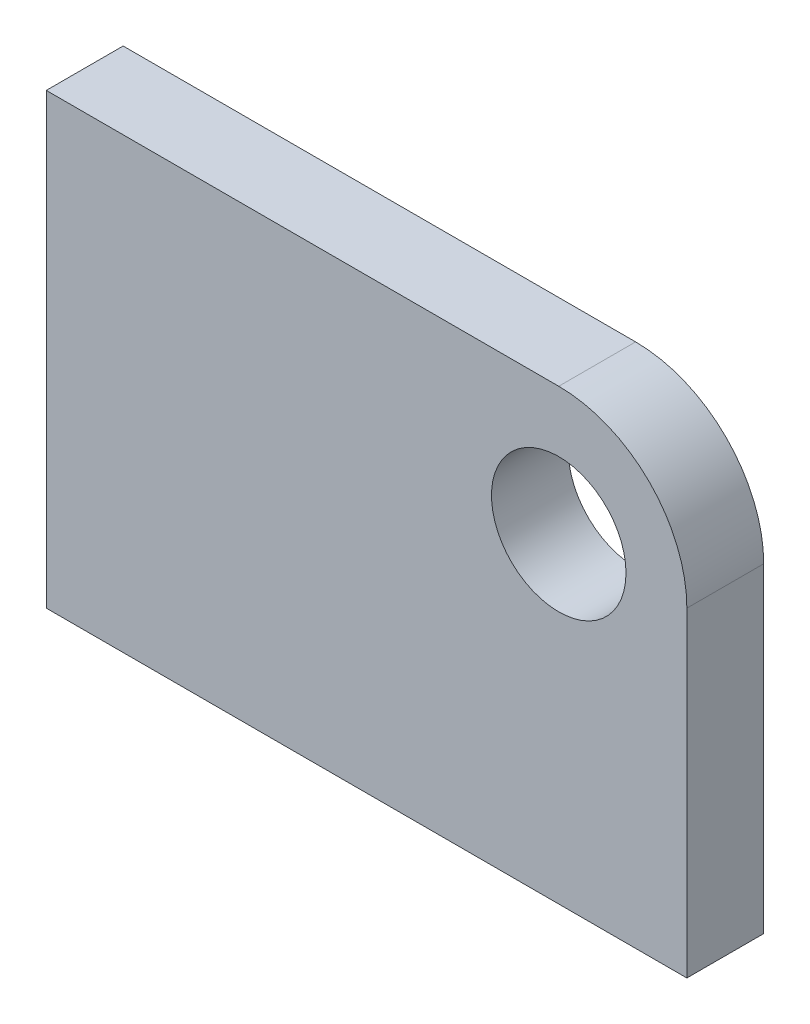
ISO-10303-21;
HEADER;
FILE_DESCRIPTION(('STEP AP214'),'2;1');
FILE_NAME('part.step','',(''),(''),'','','');
FILE_SCHEMA(('AUTOMOTIVE_DESIGN { 1 0 10303 214 1 1 1 1 }'));
ENDSEC;
DATA;
#1=APPLICATION_CONTEXT('core data for automotive mechanical design processes');
#2=APPLICATION_PROTOCOL_DEFINITION('international standard','automotive_design',2000,#1);
#3=PRODUCT_CONTEXT('',#1,'mechanical');
#4=PRODUCT('Part','Part','',(#3));
#5=PRODUCT_RELATED_PRODUCT_CATEGORY('part','',(#4));
#6=PRODUCT_DEFINITION_FORMATION('','',#4);
#7=PRODUCT_DEFINITION_CONTEXT('part definition',#1,'design');
#8=PRODUCT_DEFINITION('design','',#6,#7);
#9=PRODUCT_DEFINITION_SHAPE('','',#8);
#10=(LENGTH_UNIT() NAMED_UNIT(*) SI_UNIT(.MILLI.,.METRE.));
#11=(NAMED_UNIT(*) PLANE_ANGLE_UNIT() SI_UNIT($,.RADIAN.));
#12=(NAMED_UNIT(*) SI_UNIT($,.STERADIAN.) SOLID_ANGLE_UNIT());
#13=UNCERTAINTY_MEASURE_WITH_UNIT(LENGTH_MEASURE(1.E-05),#10,'distance_accuracy_value','');
#14=(GEOMETRIC_REPRESENTATION_CONTEXT(3) GLOBAL_UNCERTAINTY_ASSIGNED_CONTEXT((#13)) GLOBAL_UNIT_ASSIGNED_CONTEXT((#10,
#11,#12)) REPRESENTATION_CONTEXT('',''));
#15=CARTESIAN_POINT('',(0.,0.,0.));
#16=DIRECTION('',(0.,0.,1.));
#17=DIRECTION('',(1.,0.,0.));
#18=AXIS2_PLACEMENT_3D('',#15,#16,#17);
#19=CARTESIAN_POINT('',(80.,-20.,12.));
#20=DIRECTION('',(0.,0.,1.));
#21=DIRECTION('',(1.,0.,0.));
#22=AXIS2_PLACEMENT_3D('',#19,#20,#21);
#23=PLANE('',#22);
#24=DIRECTION('',(0.,-1.,0.));
#25=VECTOR('',#24,1.);
#26=CARTESIAN_POINT('',(0.,0.,12.));
#27=LINE('',#26,#25);
#28=CARTESIAN_POINT('',(0.,0.,12.));
#29=VERTEX_POINT('',#28);
#30=CARTESIAN_POINT('',(0.,-70.,12.));
#31=VERTEX_POINT('',#30);
#32=EDGE_CURVE('E108',#29,#31,#27,.T.);
#33=ORIENTED_EDGE('',*,*,#32,.T.);
#34=DIRECTION('',(1.,0.,0.));
#35=VECTOR('',#34,1.);
#36=CARTESIAN_POINT('',(0.,-70.,12.));
#37=LINE('',#36,#35);
#38=CARTESIAN_POINT('',(100.,-70.,12.));
#39=VERTEX_POINT('',#38);
#40=EDGE_CURVE('E91',#31,#39,#37,.T.);
#41=ORIENTED_EDGE('',*,*,#40,.T.);
#42=DIRECTION('',(0.,1.,0.));
#43=VECTOR('',#42,1.);
#44=CARTESIAN_POINT('',(100.,-20.0000000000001,12.));
#45=LINE('',#44,#43);
#46=CARTESIAN_POINT('',(100.,-20.0000000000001,12.));
#47=VERTEX_POINT('',#46);
#48=EDGE_CURVE('E111',#39,#47,#45,.T.);
#49=ORIENTED_EDGE('',*,*,#48,.T.);
#50=CARTESIAN_POINT('',(80.,-20.,12.));
#51=DIRECTION('',(0.,0.,1.));
#52=DIRECTION('',(1.,0.,0.));
#53=AXIS2_PLACEMENT_3D('',#50,#51,#52);
#54=CIRCLE('',#53,20.);
#55=CARTESIAN_POINT('',(79.9999999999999,0.,12.));
#56=VERTEX_POINT('',#55);
#57=EDGE_CURVE('E50',#47,#56,#54,.T.);
#58=ORIENTED_EDGE('',*,*,#57,.T.);
#59=DIRECTION('',(-1.,0.,0.));
#60=VECTOR('',#59,1.);
#61=CARTESIAN_POINT('',(0.,0.,12.));
#62=LINE('',#61,#60);
#63=EDGE_CURVE('E45',#56,#29,#62,.T.);
#64=ORIENTED_EDGE('',*,*,#63,.T.);
#65=EDGE_LOOP('',(#33,#41,#49,#58,#64));
#66=FACE_BOUND('',#65,.T.);
#67=CARTESIAN_POINT('',(80.,-20.,12.));
#68=DIRECTION('',(0.,0.,1.));
#69=DIRECTION('',(1.,0.,0.));
#70=AXIS2_PLACEMENT_3D('',#67,#68,#69);
#71=CIRCLE('',#70,10.5);
#72=CARTESIAN_POINT('',(90.5,-20.,12.));
#73=VERTEX_POINT('',#72);
#74=EDGE_CURVE('E96',#73,#73,#71,.T.);
#75=ORIENTED_EDGE('',*,*,#74,.F.);
#76=EDGE_LOOP('',(#75));
#77=FACE_BOUND('',#76,.T.);
#78=ADVANCED_FACE('F30',(#66,#77),#23,.T.);
#79=CARTESIAN_POINT('',(80.,-20.,0.));
#80=DIRECTION('',(0.,0.,1.));
#81=DIRECTION('',(1.,0.,0.));
#82=AXIS2_PLACEMENT_3D('',#79,#80,#81);
#83=PLANE('',#82);
#84=DIRECTION('',(0.,-1.,0.));
#85=VECTOR('',#84,1.);
#86=CARTESIAN_POINT('',(0.,0.,0.));
#87=LINE('',#86,#85);
#88=CARTESIAN_POINT('',(0.,0.,0.));
#89=VERTEX_POINT('',#88);
#90=CARTESIAN_POINT('',(0.,-70.,0.));
#91=VERTEX_POINT('',#90);
#92=EDGE_CURVE('E82',#89,#91,#87,.T.);
#93=ORIENTED_EDGE('',*,*,#92,.F.);
#94=DIRECTION('',(-1.,0.,0.));
#95=VECTOR('',#94,1.);
#96=CARTESIAN_POINT('',(0.,0.,0.));
#97=LINE('',#96,#95);
#98=CARTESIAN_POINT('',(79.9999999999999,0.,0.));
#99=VERTEX_POINT('',#98);
#100=EDGE_CURVE('E106',#99,#89,#97,.T.);
#101=ORIENTED_EDGE('',*,*,#100,.F.);
#102=CARTESIAN_POINT('',(80.,-20.,0.));
#103=DIRECTION('',(0.,0.,1.));
#104=DIRECTION('',(1.,0.,0.));
#105=AXIS2_PLACEMENT_3D('',#102,#103,#104);
#106=CIRCLE('',#105,20.);
#107=CARTESIAN_POINT('',(100.,-20.0000000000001,0.));
#108=VERTEX_POINT('',#107);
#109=EDGE_CURVE('E104',#108,#99,#106,.T.);
#110=ORIENTED_EDGE('',*,*,#109,.F.);
#111=DIRECTION('',(0.,1.,0.));
#112=VECTOR('',#111,1.);
#113=CARTESIAN_POINT('',(100.,-20.0000000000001,0.));
#114=LINE('',#113,#112);
#115=CARTESIAN_POINT('',(100.,-70.,0.));
#116=VERTEX_POINT('',#115);
#117=EDGE_CURVE('E84',#116,#108,#114,.T.);
#118=ORIENTED_EDGE('',*,*,#117,.F.);
#119=DIRECTION('',(1.,0.,0.));
#120=VECTOR('',#119,1.);
#121=CARTESIAN_POINT('',(0.,-70.,0.));
#122=LINE('',#121,#120);
#123=EDGE_CURVE('E77',#91,#116,#122,.T.);
#124=ORIENTED_EDGE('',*,*,#123,.F.);
#125=EDGE_LOOP('',(#93,#101,#110,#118,#124));
#126=FACE_BOUND('',#125,.T.);
#127=CARTESIAN_POINT('',(80.,-20.,0.));
#128=DIRECTION('',(0.,0.,1.));
#129=DIRECTION('',(1.,0.,0.));
#130=AXIS2_PLACEMENT_3D('',#127,#128,#129);
#131=CIRCLE('',#130,10.5);
#132=CARTESIAN_POINT('',(90.5,-20.,0.));
#133=VERTEX_POINT('',#132);
#134=EDGE_CURVE('E99',#133,#133,#131,.T.);
#135=ORIENTED_EDGE('',*,*,#134,.T.);
#136=EDGE_LOOP('',(#135));
#137=FACE_BOUND('',#136,.T.);
#138=ADVANCED_FACE('F78',(#126,#137),#83,.F.);
#139=CARTESIAN_POINT('',(0.,0.,12.));
#140=DIRECTION('',(1.,0.,0.));
#141=DIRECTION('',(0.,1.,0.));
#142=AXIS2_PLACEMENT_3D('',#139,#140,#141);
#143=PLANE('',#142);
#144=ORIENTED_EDGE('',*,*,#92,.T.);
#145=DIRECTION('',(0.,0.,-1.));
#146=VECTOR('',#145,1.);
#147=CARTESIAN_POINT('',(0.,-70.,12.));
#148=LINE('',#147,#146);
#149=EDGE_CURVE('E11',#31,#91,#148,.T.);
#150=ORIENTED_EDGE('',*,*,#149,.F.);
#151=ORIENTED_EDGE('',*,*,#32,.F.);
#152=DIRECTION('',(0.,0.,-1.));
#153=VECTOR('',#152,1.);
#154=CARTESIAN_POINT('',(0.,0.,12.));
#155=LINE('',#154,#153);
#156=EDGE_CURVE('E95',#29,#89,#155,.T.);
#157=ORIENTED_EDGE('',*,*,#156,.T.);
#158=EDGE_LOOP('',(#144,#150,#151,#157));
#159=FACE_BOUND('',#158,.T.);
#160=ADVANCED_FACE('F32',(#159),#143,.F.);
#161=CARTESIAN_POINT('',(0.,-70.,12.));
#162=DIRECTION('',(0.,1.,0.));
#163=DIRECTION('',(0.,0.,1.));
#164=AXIS2_PLACEMENT_3D('',#161,#162,#163);
#165=PLANE('',#164);
#166=ORIENTED_EDGE('',*,*,#123,.T.);
#167=DIRECTION('',(0.,0.,-1.));
#168=VECTOR('',#167,1.);
#169=CARTESIAN_POINT('',(100.,-70.,12.));
#170=LINE('',#169,#168);
#171=EDGE_CURVE('E38',#39,#116,#170,.T.);
#172=ORIENTED_EDGE('',*,*,#171,.F.);
#173=ORIENTED_EDGE('',*,*,#40,.F.);
#174=ORIENTED_EDGE('',*,*,#149,.T.);
#175=EDGE_LOOP('',(#166,#172,#173,#174));
#176=FACE_BOUND('',#175,.T.);
#177=ADVANCED_FACE('F90',(#176),#165,.F.);
#178=CARTESIAN_POINT('',(100.,-20.0000000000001,12.));
#179=DIRECTION('',(-1.,0.,0.));
#180=DIRECTION('',(0.,0.,1.));
#181=AXIS2_PLACEMENT_3D('',#178,#179,#180);
#182=PLANE('',#181);
#183=ORIENTED_EDGE('',*,*,#117,.T.);
#184=DIRECTION('',(0.,0.,-1.));
#185=VECTOR('',#184,1.);
#186=CARTESIAN_POINT('',(100.,-20.0000000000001,12.));
#187=LINE('',#186,#185);
#188=EDGE_CURVE('E119',#47,#108,#187,.T.);
#189=ORIENTED_EDGE('',*,*,#188,.F.);
#190=ORIENTED_EDGE('',*,*,#48,.F.);
#191=ORIENTED_EDGE('',*,*,#171,.T.);
#192=EDGE_LOOP('',(#183,#189,#190,#191));
#193=FACE_BOUND('',#192,.T.);
#194=ADVANCED_FACE('F123',(#193),#182,.F.);
#195=CARTESIAN_POINT('',(80.,-20.,12.));
#196=DIRECTION('',(0.,0.,-1.));
#197=DIRECTION('',(-1.,0.,0.));
#198=AXIS2_PLACEMENT_3D('',#195,#196,#197);
#199=CYLINDRICAL_SURFACE('',#198,20.);
#200=ORIENTED_EDGE('',*,*,#109,.T.);
#201=DIRECTION('',(0.,0.,-1.));
#202=VECTOR('',#201,1.);
#203=CARTESIAN_POINT('',(79.9999999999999,0.,12.));
#204=LINE('',#203,#202);
#205=EDGE_CURVE('E116',#56,#99,#204,.T.);
#206=ORIENTED_EDGE('',*,*,#205,.F.);
#207=ORIENTED_EDGE('',*,*,#57,.F.);
#208=ORIENTED_EDGE('',*,*,#188,.T.);
#209=EDGE_LOOP('',(#200,#206,#207,#208));
#210=FACE_BOUND('',#209,.T.);
#211=ADVANCED_FACE('F145',(#210),#199,.T.);
#212=CARTESIAN_POINT('',(0.,0.,12.));
#213=DIRECTION('',(0.,-1.,0.));
#214=DIRECTION('',(0.,0.,-1.));
#215=AXIS2_PLACEMENT_3D('',#212,#213,#214);
#216=PLANE('',#215);
#217=ORIENTED_EDGE('',*,*,#100,.T.);
#218=ORIENTED_EDGE('',*,*,#156,.F.);
#219=ORIENTED_EDGE('',*,*,#63,.F.);
#220=ORIENTED_EDGE('',*,*,#205,.T.);
#221=EDGE_LOOP('',(#217,#218,#219,#220));
#222=FACE_BOUND('',#221,.T.);
#223=ADVANCED_FACE('F133',(#222),#216,.F.);
#224=CARTESIAN_POINT('',(80.,-20.,12.));
#225=DIRECTION('',(0.,0.,-1.));
#226=DIRECTION('',(-1.,0.,0.));
#227=AXIS2_PLACEMENT_3D('',#224,#225,#226);
#228=CYLINDRICAL_SURFACE('',#227,10.5);
#229=ORIENTED_EDGE('',*,*,#74,.T.);
#230=EDGE_LOOP('',(#229));
#231=FACE_BOUND('',#230,.T.);
#232=ORIENTED_EDGE('',*,*,#134,.F.);
#233=EDGE_LOOP('',(#232));
#234=FACE_BOUND('',#233,.T.);
#235=ADVANCED_FACE('F130',(#231,#234),#228,.F.);
#236=CLOSED_SHELL('',(#78,#138,#160,#177,#194,#211,#223,#235));
#237=MANIFOLD_SOLID_BREP('B2',#236);
#238=ADVANCED_BREP_SHAPE_REPRESENTATION('',(#18,#237),#14);
#239=SHAPE_DEFINITION_REPRESENTATION(#9,#238);
ENDSEC;
END-ISO-10303-21;
